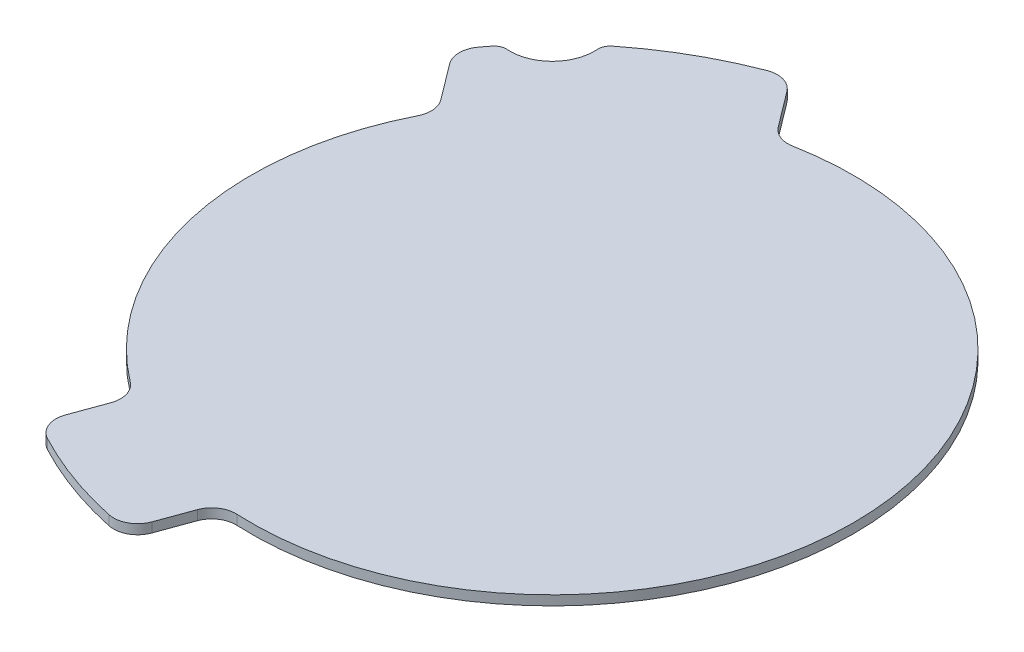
ISO-10303-21;
HEADER;
FILE_DESCRIPTION(('STEP AP214'),'2;1');
FILE_NAME('part.step','',(''),(''),'','','');
FILE_SCHEMA(('AUTOMOTIVE_DESIGN { 1 0 10303 214 1 1 1 1 }'));
ENDSEC;
DATA;
#1=APPLICATION_CONTEXT('core data for automotive mechanical design processes');
#2=APPLICATION_PROTOCOL_DEFINITION('international standard','automotive_design',2000,#1);
#3=PRODUCT_CONTEXT('',#1,'mechanical');
#4=PRODUCT('Part','Part','',(#3));
#5=PRODUCT_RELATED_PRODUCT_CATEGORY('part','',(#4));
#6=PRODUCT_DEFINITION_FORMATION('','',#4);
#7=PRODUCT_DEFINITION_CONTEXT('part definition',#1,'design');
#8=PRODUCT_DEFINITION('design','',#6,#7);
#9=PRODUCT_DEFINITION_SHAPE('','',#8);
#10=(LENGTH_UNIT() NAMED_UNIT(*) SI_UNIT(.MILLI.,.METRE.));
#11=(NAMED_UNIT(*) PLANE_ANGLE_UNIT() SI_UNIT($,.RADIAN.));
#12=(NAMED_UNIT(*) SI_UNIT($,.STERADIAN.) SOLID_ANGLE_UNIT());
#13=UNCERTAINTY_MEASURE_WITH_UNIT(LENGTH_MEASURE(1.E-05),#10,'distance_accuracy_value','');
#14=(GEOMETRIC_REPRESENTATION_CONTEXT(3) GLOBAL_UNCERTAINTY_ASSIGNED_CONTEXT((#13)) GLOBAL_UNIT_ASSIGNED_CONTEXT((#10,
#11,#12)) REPRESENTATION_CONTEXT('',''));
#15=CARTESIAN_POINT('',(0.,0.,0.));
#16=DIRECTION('',(0.,0.,1.));
#17=DIRECTION('',(1.,0.,0.));
#18=AXIS2_PLACEMENT_3D('',#15,#16,#17);
#19=CARTESIAN_POINT('',(0.,0.,0.));
#20=DIRECTION('',(0.,1.,0.));
#21=DIRECTION('',(0.,0.,1.));
#22=AXIS2_PLACEMENT_3D('',#19,#20,#21);
#23=PLANE('',#22);
#24=CARTESIAN_POINT('',(-23.4829567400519,0.,-18.6695137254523));
#25=DIRECTION('',(0.,1.,0.));
#26=DIRECTION('',(0.,0.,1.));
#27=AXIS2_PLACEMENT_3D('',#24,#25,#26);
#28=CIRCLE('',#27,1.);
#29=CARTESIAN_POINT('',(-23.4106879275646,0.,-19.6668989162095));
#30=VERTEX_POINT('',#29);
#31=CARTESIAN_POINT('',(-24.2657219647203,0.,-19.2918308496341));
#32=VERTEX_POINT('',#31);
#33=EDGE_CURVE('E20',#30,#32,#28,.T.);
#34=ORIENTED_EDGE('',*,*,#33,.F.);
#35=CARTESIAN_POINT('',(-23.1577470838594,0.,-23.1577470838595));
#36=DIRECTION('',(0.,1.,0.));
#37=DIRECTION('',(0.,0.,1.));
#38=AXIS2_PLACEMENT_3D('',#35,#36,#37);
#39=CIRCLE('',#38,3.49999999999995);
#40=CARTESIAN_POINT('',(-19.6668989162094,0.,-23.4106879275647));
#41=VERTEX_POINT('',#40);
#42=EDGE_CURVE('E154',#30,#41,#39,.T.);
#43=ORIENTED_EDGE('',*,*,#42,.T.);
#44=CARTESIAN_POINT('',(-18.6695137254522,0.,-23.4829567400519));
#45=DIRECTION('',(0.,-1.,0.));
#46=DIRECTION('',(0.,0.,-1.));
#47=AXIS2_PLACEMENT_3D('',#44,#45,#46);
#48=CIRCLE('',#47,1.);
#49=CARTESIAN_POINT('',(-19.291830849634,0.,-24.2657219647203));
#50=VERTEX_POINT('',#49);
#51=EDGE_CURVE('E230',#50,#41,#48,.F.);
#52=ORIENTED_EDGE('',*,*,#51,.F.);
#53=CARTESIAN_POINT('',(0.,0.,0.));
#54=DIRECTION('',(0.,-1.,0.));
#55=DIRECTION('',(0.,0.,-1.));
#56=AXIS2_PLACEMENT_3D('',#53,#54,#55);
#57=CIRCLE('',#56,31.);
#58=CARTESIAN_POINT('',(-11.1026403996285,0.,-28.9435895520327));
#59=VERTEX_POINT('',#58);
#60=EDGE_CURVE('E234',#59,#50,#57,.F.);
#61=ORIENTED_EDGE('',*,*,#60,.F.);
#62=CARTESIAN_POINT('',(-10.3863410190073,0.,-27.0762611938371));
#63=DIRECTION('',(0.,-1.,0.));
#64=DIRECTION('',(0.,0.,-1.));
#65=AXIS2_PLACEMENT_3D('',#62,#63,#64);
#66=CIRCLE('',#65,2.);
#67=CARTESIAN_POINT('',(-8.7890699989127,0.,-28.2798912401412));
#68=VERTEX_POINT('',#67);
#69=EDGE_CURVE('E237',#68,#59,#66,.F.);
#70=ORIENTED_EDGE('',*,*,#69,.F.);
#71=DIRECTION('',(0.601815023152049,0.,0.798635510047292));
#72=VECTOR('',#71,1.);
#73=CARTESIAN_POINT('',(-5.80295938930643,0.,-24.3171886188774));
#74=LINE('',#73,#72);
#75=CARTESIAN_POINT('',(-6.56960839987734,0.,-25.3345662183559));
#76=VERTEX_POINT('',#75);
#77=EDGE_CURVE('E172',#68,#76,#74,.T.);
#78=ORIENTED_EDGE('',*,*,#77,.T.);
#79=CARTESIAN_POINT('',(-4.97233737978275,0.,-26.53819626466));
#80=DIRECTION('',(0.,-1.,0.));
#81=DIRECTION('',(0.,0.,-1.));
#82=AXIS2_PLACEMENT_3D('',#79,#80,#81);
#83=CIRCLE('',#82,2.);
#84=CARTESIAN_POINT('',(-4.60401609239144,0.,-24.5724039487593));
#85=VERTEX_POINT('',#84);
#86=EDGE_CURVE('E240',#76,#85,#83,.F.);
#87=ORIENTED_EDGE('',*,*,#86,.T.);
#88=CARTESIAN_POINT('',(0.,0.,0.));
#89=DIRECTION('',(0.,-1.,0.));
#90=DIRECTION('',(0.,0.,-1.));
#91=AXIS2_PLACEMENT_3D('',#88,#89,#90);
#92=CIRCLE('',#91,25.);
#93=CARTESIAN_POINT('',(-1.20586629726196,0.,24.970900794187));
#94=VERTEX_POINT('',#93);
#95=EDGE_CURVE('E243',#94,#85,#92,.F.);
#96=ORIENTED_EDGE('',*,*,#95,.F.);
#97=CARTESIAN_POINT('',(-1.30233560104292,0.,26.9685728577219));
#98=DIRECTION('',(0.,1.,0.));
#99=DIRECTION('',(0.,0.,1.));
#100=AXIS2_PLACEMENT_3D('',#97,#98,#99);
#101=CIRCLE('',#100,2.);
#102=CARTESIAN_POINT('',(-3.18172084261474,0.,26.2845325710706));
#103=VERTEX_POINT('',#102);
#104=EDGE_CURVE('E247',#94,#103,#101,.T.);
#105=ORIENTED_EDGE('',*,*,#104,.T.);
#106=DIRECTION('',(-0.342020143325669,0.,0.939692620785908));
#107=VECTOR('',#106,1.);
#108=CARTESIAN_POINT('',(-2.66244133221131,0.,24.8578238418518));
#109=LINE('',#108,#107);
#110=CARTESIAN_POINT('',(-4.18562497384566,0.,29.0427365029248));
#111=VERTEX_POINT('',#110);
#112=EDGE_CURVE('E177',#103,#111,#109,.T.);
#113=ORIENTED_EDGE('',*,*,#112,.T.);
#114=CARTESIAN_POINT('',(-6.06501021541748,0.,28.3586962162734));
#115=DIRECTION('',(0.,-1.,0.));
#116=DIRECTION('',(0.,0.,-1.));
#117=AXIS2_PLACEMENT_3D('',#114,#115,#116);
#118=CIRCLE('',#117,2.);
#119=CARTESIAN_POINT('',(-6.483286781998,0.,30.3144683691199));
#120=VERTEX_POINT('',#119);
#121=EDGE_CURVE('E180',#120,#111,#118,.F.);
#122=ORIENTED_EDGE('',*,*,#121,.F.);
#123=CARTESIAN_POINT('',(0.,0.,0.));
#124=DIRECTION('',(0.,-1.,0.));
#125=DIRECTION('',(0.,0.,-1.));
#126=AXIS2_PLACEMENT_3D('',#123,#124,#125);
#127=CIRCLE('',#126,31.);
#128=CARTESIAN_POINT('',(-14.5192788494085,0.,27.3896064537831));
#129=VERTEX_POINT('',#128);
#130=EDGE_CURVE('E253',#129,#120,#127,.F.);
#131=ORIENTED_EDGE('',*,*,#130,.F.);
#132=CARTESIAN_POINT('',(-13.5825511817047,0.,25.6225350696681));
#133=DIRECTION('',(0.,-1.,0.));
#134=DIRECTION('',(0.,0.,-1.));
#135=AXIS2_PLACEMENT_3D('',#132,#133,#134);
#136=CIRCLE('',#135,2.);
#137=CARTESIAN_POINT('',(-15.4619364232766,0.,24.9384947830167));
#138=VERTEX_POINT('',#137);
#139=EDGE_CURVE('E256',#138,#129,#136,.F.);
#140=ORIENTED_EDGE('',*,*,#139,.F.);
#141=DIRECTION('',(0.342020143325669,0.,-0.939692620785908));
#142=VECTOR('',#141,1.);
#143=CARTESIAN_POINT('',(-13.9387527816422,0.,20.7535821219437));
#144=LINE('',#143,#142);
#145=CARTESIAN_POINT('',(-14.4580322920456,0.,22.1802908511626));
#146=VERTEX_POINT('',#145);
#147=EDGE_CURVE('E181',#138,#146,#144,.T.);
#148=ORIENTED_EDGE('',*,*,#147,.T.);
#149=CARTESIAN_POINT('',(-16.3374175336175,0.,21.4962505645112));
#150=DIRECTION('',(0.,-1.,0.));
#151=DIRECTION('',(0.,0.,-1.));
#152=AXIS2_PLACEMENT_3D('',#149,#150,#151);
#153=CIRCLE('',#152,2.);
#154=CARTESIAN_POINT('',(-15.1272384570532,0.,19.9039357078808));
#155=VERTEX_POINT('',#154);
#156=EDGE_CURVE('E259',#146,#155,#153,.F.);
#157=ORIENTED_EDGE('',*,*,#156,.T.);
#158=CARTESIAN_POINT('',(0.,0.,0.));
#159=DIRECTION('',(0.,-1.,0.));
#160=DIRECTION('',(0.,0.,-1.));
#161=AXIS2_PLACEMENT_3D('',#158,#159,#160);
#162=CIRCLE('',#161,25.);
#163=CARTESIAN_POINT('',(-22.3514718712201,0.,-11.1987367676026));
#164=VERTEX_POINT('',#163);
#165=EDGE_CURVE('E261',#164,#155,#162,.F.);
#166=ORIENTED_EDGE('',*,*,#165,.F.);
#167=CARTESIAN_POINT('',(-24.1395896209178,0.,-12.0946357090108));
#168=DIRECTION('',(0.,-1.,0.));
#169=DIRECTION('',(0.,0.,-1.));
#170=AXIS2_PLACEMENT_3D('',#167,#168,#169);
#171=CIRCLE('',#170,2.);
#172=CARTESIAN_POINT('',(-22.5423186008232,0.,-13.2982657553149));
#173=VERTEX_POINT('',#172);
#174=EDGE_CURVE('E265',#164,#173,#171,.F.);
#175=ORIENTED_EDGE('',*,*,#174,.T.);
#176=DIRECTION('',(-0.60181502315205,0.,-0.798635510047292));
#177=VECTOR('',#176,1.);
#178=CARTESIAN_POINT('',(-21.7756695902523,0.,-12.2808881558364));
#179=LINE('',#178,#177);
#180=CARTESIAN_POINT('',(-24.7617801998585,0.,-16.2435907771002));
#181=VERTEX_POINT('',#180);
#182=EDGE_CURVE('E185',#173,#181,#179,.T.);
#183=ORIENTED_EDGE('',*,*,#182,.T.);
#184=CARTESIAN_POINT('',(-23.164509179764,0.,-17.4472208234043));
#185=DIRECTION('',(0.,-1.,0.));
#186=DIRECTION('',(0.,0.,-1.));
#187=AXIS2_PLACEMENT_3D('',#184,#185,#186);
#188=CIRCLE('',#187,2.);
#189=CARTESIAN_POINT('',(-24.7620615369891,0.,-18.6504774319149));
#190=VERTEX_POINT('',#189);
#191=EDGE_CURVE('E187',#190,#181,#188,.F.);
#192=ORIENTED_EDGE('',*,*,#191,.F.);
#193=CARTESIAN_POINT('',(0.,0.,0.));
#194=DIRECTION('',(0.,-1.,0.));
#195=DIRECTION('',(0.,0.,-1.));
#196=AXIS2_PLACEMENT_3D('',#193,#194,#195);
#197=CIRCLE('',#196,31.);
#198=EDGE_CURVE('E162',#32,#190,#197,.F.);
#199=ORIENTED_EDGE('',*,*,#198,.F.);
#200=EDGE_LOOP('',(#34,#43,#52,#61,#70,#78,#87,#96,#105,#113,#122,#131,#140,#148,#157,#166,#175,
#183,#192,#199));
#201=FACE_BOUND('',#200,.T.);
#202=ADVANCED_FACE('F17',(#201),#23,.F.);
#203=CARTESIAN_POINT('',(-23.4829567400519,-9.2,-18.6695137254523));
#204=DIRECTION('',(0.,1.,0.));
#205=DIRECTION('',(0.,0.,1.));
#206=AXIS2_PLACEMENT_3D('',#203,#204,#205);
#207=CYLINDRICAL_SURFACE('',#206,1.);
#208=ORIENTED_EDGE('',*,*,#33,.T.);
#209=DIRECTION('',(0.,-1.,0.));
#210=VECTOR('',#209,1.);
#211=CARTESIAN_POINT('',(-24.2657219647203,0.8,-19.2918308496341));
#212=LINE('',#211,#210);
#213=CARTESIAN_POINT('',(-24.2657219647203,0.8,-19.2918308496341));
#214=VERTEX_POINT('',#213);
#215=EDGE_CURVE('E164',#214,#32,#212,.T.);
#216=ORIENTED_EDGE('',*,*,#215,.F.);
#217=CARTESIAN_POINT('',(-23.4829567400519,0.8,-18.6695137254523));
#218=DIRECTION('',(0.,1.,0.));
#219=DIRECTION('',(0.,0.,1.));
#220=AXIS2_PLACEMENT_3D('',#217,#218,#219);
#221=CIRCLE('',#220,1.);
#222=CARTESIAN_POINT('',(-23.4106879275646,0.8,-19.6668989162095));
#223=VERTEX_POINT('',#222);
#224=EDGE_CURVE('E167',#223,#214,#221,.T.);
#225=ORIENTED_EDGE('',*,*,#224,.F.);
#226=DIRECTION('',(0.,1.,0.));
#227=VECTOR('',#226,1.);
#228=CARTESIAN_POINT('',(-23.4106879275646,-9.2,-19.6668989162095));
#229=LINE('',#228,#227);
#230=EDGE_CURVE('E156',#223,#30,#229,.F.);
#231=ORIENTED_EDGE('',*,*,#230,.T.);
#232=EDGE_LOOP('',(#208,#216,#225,#231));
#233=FACE_BOUND('',#232,.T.);
#234=ADVANCED_FACE('F165',(#233),#207,.T.);
#235=CARTESIAN_POINT('',(0.,0.8,0.));
#236=DIRECTION('',(0.,-1.,0.));
#237=DIRECTION('',(0.,0.,-1.));
#238=AXIS2_PLACEMENT_3D('',#235,#236,#237);
#239=CYLINDRICAL_SURFACE('',#238,31.);
#240=ORIENTED_EDGE('',*,*,#198,.T.);
#241=DIRECTION('',(0.,-1.,0.));
#242=VECTOR('',#241,1.);
#243=CARTESIAN_POINT('',(-24.7620615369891,0.8,-18.6504774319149));
#244=LINE('',#243,#242);
#245=CARTESIAN_POINT('',(-24.7620615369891,0.8,-18.6504774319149));
#246=VERTEX_POINT('',#245);
#247=EDGE_CURVE('E269',#246,#190,#244,.T.);
#248=ORIENTED_EDGE('',*,*,#247,.F.);
#249=CARTESIAN_POINT('',(0.,0.8,0.));
#250=DIRECTION('',(0.,-1.,0.));
#251=DIRECTION('',(0.,0.,-1.));
#252=AXIS2_PLACEMENT_3D('',#249,#250,#251);
#253=CIRCLE('',#252,31.);
#254=EDGE_CURVE('E225',#214,#246,#253,.F.);
#255=ORIENTED_EDGE('',*,*,#254,.F.);
#256=ORIENTED_EDGE('',*,*,#215,.T.);
#257=EDGE_LOOP('',(#240,#248,#255,#256));
#258=FACE_BOUND('',#257,.T.);
#259=ADVANCED_FACE('F273',(#258),#239,.T.);
#260=CARTESIAN_POINT('',(-23.164509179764,0.8,-17.4472208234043));
#261=DIRECTION('',(0.,-1.,0.));
#262=DIRECTION('',(0.,0.,-1.));
#263=AXIS2_PLACEMENT_3D('',#260,#261,#262);
#264=CYLINDRICAL_SURFACE('',#263,2.);
#265=ORIENTED_EDGE('',*,*,#191,.T.);
#266=DIRECTION('',(0.,1.,0.));
#267=VECTOR('',#266,1.);
#268=CARTESIAN_POINT('',(-24.7617801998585,0.8,-16.2435907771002));
#269=LINE('',#268,#267);
#270=CARTESIAN_POINT('',(-24.7617801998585,0.8,-16.2435907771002));
#271=VERTEX_POINT('',#270);
#272=EDGE_CURVE('E186',#181,#271,#269,.T.);
#273=ORIENTED_EDGE('',*,*,#272,.T.);
#274=CARTESIAN_POINT('',(-23.164509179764,0.8,-17.4472208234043));
#275=DIRECTION('',(0.,-1.,0.));
#276=DIRECTION('',(0.,0.,-1.));
#277=AXIS2_PLACEMENT_3D('',#274,#275,#276);
#278=CIRCLE('',#277,2.);
#279=EDGE_CURVE('E222',#246,#271,#278,.F.);
#280=ORIENTED_EDGE('',*,*,#279,.F.);
#281=ORIENTED_EDGE('',*,*,#247,.T.);
#282=EDGE_LOOP('',(#265,#273,#280,#281));
#283=FACE_BOUND('',#282,.T.);
#284=ADVANCED_FACE('F312',(#283),#264,.T.);
#285=CARTESIAN_POINT('',(-21.7756695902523,0.8,-12.2808881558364));
#286=DIRECTION('',(0.798635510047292,0.,-0.60181502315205));
#287=DIRECTION('',(-0.60181502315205,0.,-0.798635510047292));
#288=AXIS2_PLACEMENT_3D('',#285,#286,#287);
#289=PLANE('',#288);
#290=ORIENTED_EDGE('',*,*,#272,.F.);
#291=ORIENTED_EDGE('',*,*,#182,.F.);
#292=DIRECTION('',(0.,-1.,0.));
#293=VECTOR('',#292,1.);
#294=CARTESIAN_POINT('',(-22.5423186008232,0.8,-13.2982657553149));
#295=LINE('',#294,#293);
#296=CARTESIAN_POINT('',(-22.5423186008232,0.8,-13.2982657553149));
#297=VERTEX_POINT('',#296);
#298=EDGE_CURVE('E267',#173,#297,#295,.F.);
#299=ORIENTED_EDGE('',*,*,#298,.T.);
#300=DIRECTION('',(0.601815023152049,0.,0.798635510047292));
#301=VECTOR('',#300,1.);
#302=CARTESIAN_POINT('',(-24.7617801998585,0.8,-16.2435907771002));
#303=LINE('',#302,#301);
#304=EDGE_CURVE('E221',#271,#297,#303,.T.);
#305=ORIENTED_EDGE('',*,*,#304,.F.);
#306=EDGE_LOOP('',(#290,#291,#299,#305));
#307=FACE_BOUND('',#306,.T.);
#308=ADVANCED_FACE('F316',(#307),#289,.F.);
#309=CARTESIAN_POINT('',(-24.1395896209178,0.8,-12.0946357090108));
#310=DIRECTION('',(0.,-1.,0.));
#311=DIRECTION('',(0.,0.,-1.));
#312=AXIS2_PLACEMENT_3D('',#309,#310,#311);
#313=CYLINDRICAL_SURFACE('',#312,2.);
#314=ORIENTED_EDGE('',*,*,#298,.F.);
#315=ORIENTED_EDGE('',*,*,#174,.F.);
#316=DIRECTION('',(0.,-1.,0.));
#317=VECTOR('',#316,1.);
#318=CARTESIAN_POINT('',(-22.3514718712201,0.8,-11.1987367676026));
#319=LINE('',#318,#317);
#320=CARTESIAN_POINT('',(-22.3514718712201,0.8,-11.1987367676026));
#321=VERTEX_POINT('',#320);
#322=EDGE_CURVE('E264',#321,#164,#319,.T.);
#323=ORIENTED_EDGE('',*,*,#322,.F.);
#324=CARTESIAN_POINT('',(-24.1395896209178,0.8,-12.0946357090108));
#325=DIRECTION('',(0.,-1.,0.));
#326=DIRECTION('',(0.,0.,-1.));
#327=AXIS2_PLACEMENT_3D('',#324,#325,#326);
#328=CIRCLE('',#327,2.);
#329=EDGE_CURVE('E218',#297,#321,#328,.T.);
#330=ORIENTED_EDGE('',*,*,#329,.F.);
#331=EDGE_LOOP('',(#314,#315,#323,#330));
#332=FACE_BOUND('',#331,.T.);
#333=ADVANCED_FACE('F321',(#332),#313,.F.);
#334=CARTESIAN_POINT('',(0.,0.8,0.));
#335=DIRECTION('',(0.,-1.,0.));
#336=DIRECTION('',(0.,0.,-1.));
#337=AXIS2_PLACEMENT_3D('',#334,#335,#336);
#338=CYLINDRICAL_SURFACE('',#337,25.);
#339=ORIENTED_EDGE('',*,*,#165,.T.);
#340=DIRECTION('',(0.,-1.,0.));
#341=VECTOR('',#340,1.);
#342=CARTESIAN_POINT('',(-15.1272384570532,0.8,19.9039357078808));
#343=LINE('',#342,#341);
#344=CARTESIAN_POINT('',(-15.1272384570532,0.8,19.9039357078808));
#345=VERTEX_POINT('',#344);
#346=EDGE_CURVE('E184',#155,#345,#343,.F.);
#347=ORIENTED_EDGE('',*,*,#346,.T.);
#348=CARTESIAN_POINT('',(0.,0.8,0.));
#349=DIRECTION('',(0.,-1.,0.));
#350=DIRECTION('',(0.,0.,-1.));
#351=AXIS2_PLACEMENT_3D('',#348,#349,#350);
#352=CIRCLE('',#351,25.);
#353=EDGE_CURVE('E215',#321,#345,#352,.F.);
#354=ORIENTED_EDGE('',*,*,#353,.F.);
#355=ORIENTED_EDGE('',*,*,#322,.T.);
#356=EDGE_LOOP('',(#339,#347,#354,#355));
#357=FACE_BOUND('',#356,.T.);
#358=ADVANCED_FACE('F324',(#357),#338,.T.);
#359=CARTESIAN_POINT('',(-16.3374175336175,0.8,21.4962505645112));
#360=DIRECTION('',(0.,-1.,0.));
#361=DIRECTION('',(0.,0.,-1.));
#362=AXIS2_PLACEMENT_3D('',#359,#360,#361);
#363=CYLINDRICAL_SURFACE('',#362,2.);
#364=ORIENTED_EDGE('',*,*,#346,.F.);
#365=ORIENTED_EDGE('',*,*,#156,.F.);
#366=DIRECTION('',(0.,1.,0.));
#367=VECTOR('',#366,1.);
#368=CARTESIAN_POINT('',(-14.4580322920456,0.8,22.1802908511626));
#369=LINE('',#368,#367);
#370=CARTESIAN_POINT('',(-14.4580322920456,0.8,22.1802908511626));
#371=VERTEX_POINT('',#370);
#372=EDGE_CURVE('E183',#146,#371,#369,.T.);
#373=ORIENTED_EDGE('',*,*,#372,.T.);
#374=CARTESIAN_POINT('',(-16.3374175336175,0.8,21.4962505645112));
#375=DIRECTION('',(0.,-1.,0.));
#376=DIRECTION('',(0.,0.,-1.));
#377=AXIS2_PLACEMENT_3D('',#374,#375,#376);
#378=CIRCLE('',#377,2.);
#379=EDGE_CURVE('E212',#345,#371,#378,.T.);
#380=ORIENTED_EDGE('',*,*,#379,.F.);
#381=EDGE_LOOP('',(#364,#365,#373,#380));
#382=FACE_BOUND('',#381,.T.);
#383=ADVANCED_FACE('F329',(#382),#363,.F.);
#384=CARTESIAN_POINT('',(-13.9387527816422,0.8,20.7535821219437));
#385=DIRECTION('',(0.939692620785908,0.,0.342020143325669));
#386=DIRECTION('',(0.342020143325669,0.,-0.939692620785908));
#387=AXIS2_PLACEMENT_3D('',#384,#385,#386);
#388=PLANE('',#387);
#389=ORIENTED_EDGE('',*,*,#372,.F.);
#390=ORIENTED_EDGE('',*,*,#147,.F.);
#391=DIRECTION('',(0.,-1.,0.));
#392=VECTOR('',#391,1.);
#393=CARTESIAN_POINT('',(-15.4619364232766,0.8,24.9384947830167));
#394=LINE('',#393,#392);
#395=CARTESIAN_POINT('',(-15.4619364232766,0.8,24.9384947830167));
#396=VERTEX_POINT('',#395);
#397=EDGE_CURVE('E258',#396,#138,#394,.T.);
#398=ORIENTED_EDGE('',*,*,#397,.F.);
#399=DIRECTION('',(-0.34202014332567,0.,0.939692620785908));
#400=VECTOR('',#399,1.);
#401=CARTESIAN_POINT('',(-14.4580322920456,0.8,22.1802908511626));
#402=LINE('',#401,#400);
#403=EDGE_CURVE('E211',#371,#396,#402,.T.);
#404=ORIENTED_EDGE('',*,*,#403,.F.);
#405=EDGE_LOOP('',(#389,#390,#398,#404));
#406=FACE_BOUND('',#405,.T.);
#407=ADVANCED_FACE('F473',(#406),#388,.F.);
#408=CARTESIAN_POINT('',(-13.5825511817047,0.8,25.6225350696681));
#409=DIRECTION('',(0.,-1.,0.));
#410=DIRECTION('',(0.,0.,-1.));
#411=AXIS2_PLACEMENT_3D('',#408,#409,#410);
#412=CYLINDRICAL_SURFACE('',#411,2.);
#413=ORIENTED_EDGE('',*,*,#139,.T.);
#414=DIRECTION('',(0.,-1.,0.));
#415=VECTOR('',#414,1.);
#416=CARTESIAN_POINT('',(-14.5192788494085,0.8,27.3896064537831));
#417=LINE('',#416,#415);
#418=CARTESIAN_POINT('',(-14.5192788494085,0.8,27.3896064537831));
#419=VERTEX_POINT('',#418);
#420=EDGE_CURVE('E255',#419,#129,#417,.T.);
#421=ORIENTED_EDGE('',*,*,#420,.F.);
#422=CARTESIAN_POINT('',(-13.5825511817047,0.8,25.6225350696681));
#423=DIRECTION('',(0.,-1.,0.));
#424=DIRECTION('',(0.,0.,-1.));
#425=AXIS2_PLACEMENT_3D('',#422,#423,#424);
#426=CIRCLE('',#425,2.);
#427=EDGE_CURVE('E208',#396,#419,#426,.F.);
#428=ORIENTED_EDGE('',*,*,#427,.F.);
#429=ORIENTED_EDGE('',*,*,#397,.T.);
#430=EDGE_LOOP('',(#413,#421,#428,#429));
#431=FACE_BOUND('',#430,.T.);
#432=ADVANCED_FACE('F464',(#431),#412,.T.);
#433=CARTESIAN_POINT('',(0.,0.8,0.));
#434=DIRECTION('',(0.,-1.,0.));
#435=DIRECTION('',(0.,0.,-1.));
#436=AXIS2_PLACEMENT_3D('',#433,#434,#435);
#437=CYLINDRICAL_SURFACE('',#436,31.);
#438=ORIENTED_EDGE('',*,*,#130,.T.);
#439=DIRECTION('',(0.,-1.,0.));
#440=VECTOR('',#439,1.);
#441=CARTESIAN_POINT('',(-6.483286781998,0.8,30.3144683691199));
#442=LINE('',#441,#440);
#443=CARTESIAN_POINT('',(-6.483286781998,0.8,30.3144683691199));
#444=VERTEX_POINT('',#443);
#445=EDGE_CURVE('E252',#444,#120,#442,.T.);
#446=ORIENTED_EDGE('',*,*,#445,.F.);
#447=CARTESIAN_POINT('',(0.,0.8,0.));
#448=DIRECTION('',(0.,-1.,0.));
#449=DIRECTION('',(0.,0.,-1.));
#450=AXIS2_PLACEMENT_3D('',#447,#448,#449);
#451=CIRCLE('',#450,31.);
#452=EDGE_CURVE('E205',#419,#444,#451,.F.);
#453=ORIENTED_EDGE('',*,*,#452,.F.);
#454=ORIENTED_EDGE('',*,*,#420,.T.);
#455=EDGE_LOOP('',(#438,#446,#453,#454));
#456=FACE_BOUND('',#455,.T.);
#457=ADVANCED_FACE('F455',(#456),#437,.T.);
#458=CARTESIAN_POINT('',(-6.06501021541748,0.8,28.3586962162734));
#459=DIRECTION('',(0.,-1.,0.));
#460=DIRECTION('',(0.,0.,-1.));
#461=AXIS2_PLACEMENT_3D('',#458,#459,#460);
#462=CYLINDRICAL_SURFACE('',#461,2.);
#463=ORIENTED_EDGE('',*,*,#121,.T.);
#464=DIRECTION('',(0.,1.,0.));
#465=VECTOR('',#464,1.);
#466=CARTESIAN_POINT('',(-4.18562497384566,0.8,29.0427365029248));
#467=LINE('',#466,#465);
#468=CARTESIAN_POINT('',(-4.18562497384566,0.8,29.0427365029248));
#469=VERTEX_POINT('',#468);
#470=EDGE_CURVE('E179',#111,#469,#467,.T.);
#471=ORIENTED_EDGE('',*,*,#470,.T.);
#472=CARTESIAN_POINT('',(-6.06501021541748,0.8,28.3586962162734));
#473=DIRECTION('',(0.,-1.,0.));
#474=DIRECTION('',(0.,0.,-1.));
#475=AXIS2_PLACEMENT_3D('',#472,#473,#474);
#476=CIRCLE('',#475,2.);
#477=EDGE_CURVE('E202',#444,#469,#476,.F.);
#478=ORIENTED_EDGE('',*,*,#477,.F.);
#479=ORIENTED_EDGE('',*,*,#445,.T.);
#480=EDGE_LOOP('',(#463,#471,#478,#479));
#481=FACE_BOUND('',#480,.T.);
#482=ADVANCED_FACE('F446',(#481),#462,.T.);
#483=CARTESIAN_POINT('',(-2.66244133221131,0.8,24.8578238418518));
#484=DIRECTION('',(-0.939692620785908,0.,-0.342020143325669));
#485=DIRECTION('',(-0.342020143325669,0.,0.939692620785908));
#486=AXIS2_PLACEMENT_3D('',#483,#484,#485);
#487=PLANE('',#486);
#488=ORIENTED_EDGE('',*,*,#470,.F.);
#489=ORIENTED_EDGE('',*,*,#112,.F.);
#490=DIRECTION('',(0.,-1.,0.));
#491=VECTOR('',#490,1.);
#492=CARTESIAN_POINT('',(-3.18172084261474,0.8,26.2845325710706));
#493=LINE('',#492,#491);
#494=CARTESIAN_POINT('',(-3.18172084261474,0.8,26.2845325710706));
#495=VERTEX_POINT('',#494);
#496=EDGE_CURVE('E249',#103,#495,#493,.F.);
#497=ORIENTED_EDGE('',*,*,#496,.T.);
#498=DIRECTION('',(0.342020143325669,0.,-0.939692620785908));
#499=VECTOR('',#498,1.);
#500=CARTESIAN_POINT('',(-4.18562497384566,0.8,29.0427365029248));
#501=LINE('',#500,#499);
#502=EDGE_CURVE('E201',#469,#495,#501,.T.);
#503=ORIENTED_EDGE('',*,*,#502,.F.);
#504=EDGE_LOOP('',(#488,#489,#497,#503));
#505=FACE_BOUND('',#504,.T.);
#506=ADVANCED_FACE('F437',(#505),#487,.F.);
#507=CARTESIAN_POINT('',(-1.30233560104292,0.8,26.9685728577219));
#508=DIRECTION('',(0.,-1.,0.));
#509=DIRECTION('',(0.,0.,-1.));
#510=AXIS2_PLACEMENT_3D('',#507,#508,#509);
#511=CYLINDRICAL_SURFACE('',#510,2.);
#512=DIRECTION('',(0.,-1.,0.));
#513=VECTOR('',#512,1.);
#514=CARTESIAN_POINT('',(-1.20586629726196,0.8,24.970900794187));
#515=LINE('',#514,#513);
#516=CARTESIAN_POINT('',(-1.20586629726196,0.8,24.970900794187));
#517=VERTEX_POINT('',#516);
#518=EDGE_CURVE('E246',#517,#94,#515,.T.);
#519=ORIENTED_EDGE('',*,*,#518,.F.);
#520=CARTESIAN_POINT('',(-1.30233560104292,0.8,26.9685728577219));
#521=DIRECTION('',(0.,-1.,0.));
#522=DIRECTION('',(0.,0.,-1.));
#523=AXIS2_PLACEMENT_3D('',#520,#521,#522);
#524=CIRCLE('',#523,2.);
#525=EDGE_CURVE('E199',#495,#517,#524,.T.);
#526=ORIENTED_EDGE('',*,*,#525,.F.);
#527=ORIENTED_EDGE('',*,*,#496,.F.);
#528=ORIENTED_EDGE('',*,*,#104,.F.);
#529=EDGE_LOOP('',(#519,#526,#527,#528));
#530=FACE_BOUND('',#529,.T.);
#531=ADVANCED_FACE('F367',(#530),#511,.F.);
#532=CARTESIAN_POINT('',(0.,0.8,0.));
#533=DIRECTION('',(0.,-1.,0.));
#534=DIRECTION('',(0.,0.,-1.));
#535=AXIS2_PLACEMENT_3D('',#532,#533,#534);
#536=CYLINDRICAL_SURFACE('',#535,25.);
#537=ORIENTED_EDGE('',*,*,#95,.T.);
#538=DIRECTION('',(0.,-1.,0.));
#539=VECTOR('',#538,1.);
#540=CARTESIAN_POINT('',(-4.60401609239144,0.8,-24.5724039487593));
#541=LINE('',#540,#539);
#542=CARTESIAN_POINT('',(-4.60401609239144,0.8,-24.5724039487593));
#543=VERTEX_POINT('',#542);
#544=EDGE_CURVE('E242',#85,#543,#541,.F.);
#545=ORIENTED_EDGE('',*,*,#544,.T.);
#546=CARTESIAN_POINT('',(0.,0.8,0.));
#547=DIRECTION('',(0.,-1.,0.));
#548=DIRECTION('',(0.,0.,-1.));
#549=AXIS2_PLACEMENT_3D('',#546,#547,#548);
#550=CIRCLE('',#549,25.);
#551=EDGE_CURVE('E197',#517,#543,#550,.F.);
#552=ORIENTED_EDGE('',*,*,#551,.F.);
#553=ORIENTED_EDGE('',*,*,#518,.T.);
#554=EDGE_LOOP('',(#537,#545,#552,#553));
#555=FACE_BOUND('',#554,.T.);
#556=ADVANCED_FACE('F355',(#555),#536,.T.);
#557=CARTESIAN_POINT('',(-4.97233737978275,0.8,-26.53819626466));
#558=DIRECTION('',(0.,-1.,0.));
#559=DIRECTION('',(0.,0.,-1.));
#560=AXIS2_PLACEMENT_3D('',#557,#558,#559);
#561=CYLINDRICAL_SURFACE('',#560,2.);
#562=ORIENTED_EDGE('',*,*,#544,.F.);
#563=ORIENTED_EDGE('',*,*,#86,.F.);
#564=DIRECTION('',(0.,1.,0.));
#565=VECTOR('',#564,1.);
#566=CARTESIAN_POINT('',(-6.56960839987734,0.8,-25.3345662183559));
#567=LINE('',#566,#565);
#568=CARTESIAN_POINT('',(-6.56960839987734,0.8,-25.3345662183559));
#569=VERTEX_POINT('',#568);
#570=EDGE_CURVE('E176',#76,#569,#567,.T.);
#571=ORIENTED_EDGE('',*,*,#570,.T.);
#572=CARTESIAN_POINT('',(-4.97233737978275,0.8,-26.53819626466));
#573=DIRECTION('',(0.,-1.,0.));
#574=DIRECTION('',(0.,0.,-1.));
#575=AXIS2_PLACEMENT_3D('',#572,#573,#574);
#576=CIRCLE('',#575,2.);
#577=EDGE_CURVE('E194',#543,#569,#576,.T.);
#578=ORIENTED_EDGE('',*,*,#577,.F.);
#579=EDGE_LOOP('',(#562,#563,#571,#578));
#580=FACE_BOUND('',#579,.T.);
#581=ADVANCED_FACE('F358',(#580),#561,.F.);
#582=CARTESIAN_POINT('',(-5.80295938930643,0.8,-24.3171886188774));
#583=DIRECTION('',(-0.798635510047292,0.,0.601815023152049));
#584=DIRECTION('',(0.601815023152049,0.,0.798635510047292));
#585=AXIS2_PLACEMENT_3D('',#582,#583,#584);
#586=PLANE('',#585);
#587=DIRECTION('',(0.,-1.,0.));
#588=VECTOR('',#587,1.);
#589=CARTESIAN_POINT('',(-8.7890699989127,0.8,-28.2798912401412));
#590=LINE('',#589,#588);
#591=CARTESIAN_POINT('',(-8.7890699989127,0.8,-28.2798912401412));
#592=VERTEX_POINT('',#591);
#593=EDGE_CURVE('E175',#592,#68,#590,.T.);
#594=ORIENTED_EDGE('',*,*,#593,.F.);
#595=DIRECTION('',(-0.60181502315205,0.,-0.798635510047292));
#596=VECTOR('',#595,1.);
#597=CARTESIAN_POINT('',(-6.56960839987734,0.8,-25.3345662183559));
#598=LINE('',#597,#596);
#599=EDGE_CURVE('E193',#569,#592,#598,.T.);
#600=ORIENTED_EDGE('',*,*,#599,.F.);
#601=ORIENTED_EDGE('',*,*,#570,.F.);
#602=ORIENTED_EDGE('',*,*,#77,.F.);
#603=EDGE_LOOP('',(#594,#600,#601,#602));
#604=FACE_BOUND('',#603,.T.);
#605=ADVANCED_FACE('F345',(#604),#586,.F.);
#606=CARTESIAN_POINT('',(-10.3863410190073,0.8,-27.0762611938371));
#607=DIRECTION('',(0.,-1.,0.));
#608=DIRECTION('',(0.,0.,-1.));
#609=AXIS2_PLACEMENT_3D('',#606,#607,#608);
#610=CYLINDRICAL_SURFACE('',#609,2.);
#611=ORIENTED_EDGE('',*,*,#69,.T.);
#612=DIRECTION('',(0.,-1.,0.));
#613=VECTOR('',#612,1.);
#614=CARTESIAN_POINT('',(-11.1026403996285,0.8,-28.9435895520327));
#615=LINE('',#614,#613);
#616=CARTESIAN_POINT('',(-11.1026403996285,0.8,-28.9435895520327));
#617=VERTEX_POINT('',#616);
#618=EDGE_CURVE('E233',#617,#59,#615,.T.);
#619=ORIENTED_EDGE('',*,*,#618,.F.);
#620=CARTESIAN_POINT('',(-10.3863410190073,0.8,-27.0762611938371));
#621=DIRECTION('',(0.,-1.,0.));
#622=DIRECTION('',(0.,0.,-1.));
#623=AXIS2_PLACEMENT_3D('',#620,#621,#622);
#624=CIRCLE('',#623,2.);
#625=EDGE_CURVE('E191',#592,#617,#624,.F.);
#626=ORIENTED_EDGE('',*,*,#625,.F.);
#627=ORIENTED_EDGE('',*,*,#593,.T.);
#628=EDGE_LOOP('',(#611,#619,#626,#627));
#629=FACE_BOUND('',#628,.T.);
#630=ADVANCED_FACE('F348',(#629),#610,.T.);
#631=CARTESIAN_POINT('',(0.,0.8,0.));
#632=DIRECTION('',(0.,-1.,0.));
#633=DIRECTION('',(0.,0.,-1.));
#634=AXIS2_PLACEMENT_3D('',#631,#632,#633);
#635=CYLINDRICAL_SURFACE('',#634,31.);
#636=CARTESIAN_POINT('',(0.,0.8,0.));
#637=DIRECTION('',(0.,-1.,0.));
#638=DIRECTION('',(0.,0.,-1.));
#639=AXIS2_PLACEMENT_3D('',#636,#637,#638);
#640=CIRCLE('',#639,31.);
#641=CARTESIAN_POINT('',(-19.291830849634,0.8,-24.2657219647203));
#642=VERTEX_POINT('',#641);
#643=EDGE_CURVE('E26',#617,#642,#640,.F.);
#644=ORIENTED_EDGE('',*,*,#643,.F.);
#645=ORIENTED_EDGE('',*,*,#618,.T.);
#646=ORIENTED_EDGE('',*,*,#60,.T.);
#647=DIRECTION('',(0.,-1.,0.));
#648=VECTOR('',#647,1.);
#649=CARTESIAN_POINT('',(-19.291830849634,-9.2,-24.2657219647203));
#650=LINE('',#649,#648);
#651=EDGE_CURVE('E232',#642,#50,#650,.T.);
#652=ORIENTED_EDGE('',*,*,#651,.F.);
#653=EDGE_LOOP('',(#644,#645,#646,#652));
#654=FACE_BOUND('',#653,.T.);
#655=ADVANCED_FACE('F350',(#654),#635,.T.);
#656=CARTESIAN_POINT('',(-18.6695137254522,-9.2,-23.4829567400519));
#657=DIRECTION('',(0.,-1.,0.));
#658=DIRECTION('',(0.,0.,-1.));
#659=AXIS2_PLACEMENT_3D('',#656,#657,#658);
#660=CYLINDRICAL_SURFACE('',#659,1.);
#661=CARTESIAN_POINT('',(-18.6695137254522,0.8,-23.4829567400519));
#662=DIRECTION('',(0.,-1.,0.));
#663=DIRECTION('',(0.,0.,-1.));
#664=AXIS2_PLACEMENT_3D('',#661,#662,#663);
#665=CIRCLE('',#664,1.);
#666=CARTESIAN_POINT('',(-19.6668989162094,0.8,-23.4106879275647));
#667=VERTEX_POINT('',#666);
#668=EDGE_CURVE('E11',#642,#667,#665,.F.);
#669=ORIENTED_EDGE('',*,*,#668,.F.);
#670=ORIENTED_EDGE('',*,*,#651,.T.);
#671=ORIENTED_EDGE('',*,*,#51,.T.);
#672=DIRECTION('',(0.,1.,0.));
#673=VECTOR('',#672,1.);
#674=CARTESIAN_POINT('',(-19.6668989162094,-9.2,-23.4106879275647));
#675=LINE('',#674,#673);
#676=EDGE_CURVE('E158',#41,#667,#675,.T.);
#677=ORIENTED_EDGE('',*,*,#676,.T.);
#678=EDGE_LOOP('',(#669,#670,#671,#677));
#679=FACE_BOUND('',#678,.T.);
#680=ADVANCED_FACE('F281',(#679),#660,.T.);
#681=CARTESIAN_POINT('',(-23.1577470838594,-9.2,-23.1577470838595));
#682=DIRECTION('',(0.,1.,0.));
#683=DIRECTION('',(0.,0.,1.));
#684=AXIS2_PLACEMENT_3D('',#681,#682,#683);
#685=CYLINDRICAL_SURFACE('',#684,3.49999999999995);
#686=ORIENTED_EDGE('',*,*,#42,.F.);
#687=ORIENTED_EDGE('',*,*,#230,.F.);
#688=CARTESIAN_POINT('',(-23.1577470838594,0.8,-23.1577470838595));
#689=DIRECTION('',(0.,1.,0.));
#690=DIRECTION('',(0.,0.,1.));
#691=AXIS2_PLACEMENT_3D('',#688,#689,#690);
#692=CIRCLE('',#691,3.49999999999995);
#693=EDGE_CURVE('E35',#667,#223,#692,.F.);
#694=ORIENTED_EDGE('',*,*,#693,.F.);
#695=ORIENTED_EDGE('',*,*,#676,.F.);
#696=EDGE_LOOP('',(#686,#687,#694,#695));
#697=FACE_BOUND('',#696,.T.);
#698=ADVANCED_FACE('F155',(#697),#685,.F.);
#699=CARTESIAN_POINT('',(0.,0.8,0.));
#700=DIRECTION('',(0.,1.,0.));
#701=DIRECTION('',(0.,0.,1.));
#702=AXIS2_PLACEMENT_3D('',#699,#700,#701);
#703=PLANE('',#702);
#704=ORIENTED_EDGE('',*,*,#668,.T.);
#705=ORIENTED_EDGE('',*,*,#693,.T.);
#706=ORIENTED_EDGE('',*,*,#224,.T.);
#707=ORIENTED_EDGE('',*,*,#254,.T.);
#708=ORIENTED_EDGE('',*,*,#279,.T.);
#709=ORIENTED_EDGE('',*,*,#304,.T.);
#710=ORIENTED_EDGE('',*,*,#329,.T.);
#711=ORIENTED_EDGE('',*,*,#353,.T.);
#712=ORIENTED_EDGE('',*,*,#379,.T.);
#713=ORIENTED_EDGE('',*,*,#403,.T.);
#714=ORIENTED_EDGE('',*,*,#427,.T.);
#715=ORIENTED_EDGE('',*,*,#452,.T.);
#716=ORIENTED_EDGE('',*,*,#477,.T.);
#717=ORIENTED_EDGE('',*,*,#502,.T.);
#718=ORIENTED_EDGE('',*,*,#525,.T.);
#719=ORIENTED_EDGE('',*,*,#551,.T.);
#720=ORIENTED_EDGE('',*,*,#577,.T.);
#721=ORIENTED_EDGE('',*,*,#599,.T.);
#722=ORIENTED_EDGE('',*,*,#625,.T.);
#723=ORIENTED_EDGE('',*,*,#643,.T.);
#724=EDGE_LOOP('',(#704,#705,#706,#707,#708,#709,#710,#711,#712,#713,#714,#715,#716,#717,#718,
#719,#720,#721,#722,#723));
#725=FACE_BOUND('',#724,.T.);
#726=ADVANCED_FACE('F276',(#725),#703,.T.);
#727=CLOSED_SHELL('',(#202,#234,#259,#284,#308,#333,#358,#383,#407,#432,#457,#482,#506,#531,
#556,#581,#605,#630,#655,#680,#698,#726));
#728=MANIFOLD_SOLID_BREP('B1',#727);
#729=ADVANCED_BREP_SHAPE_REPRESENTATION('',(#18,#728),#14);
#730=SHAPE_DEFINITION_REPRESENTATION(#9,#729);
ENDSEC;
END-ISO-10303-21;
